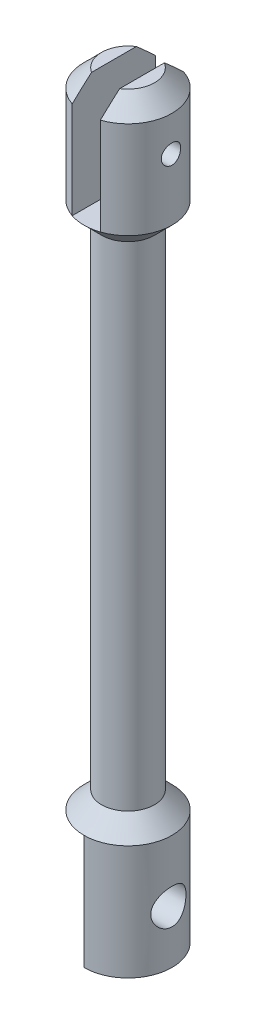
ISO-10303-21;
HEADER;
FILE_DESCRIPTION(('STEP AP214'),'2;1');
FILE_NAME('part.step','',(''),(''),'','','');
FILE_SCHEMA(('AUTOMOTIVE_DESIGN { 1 0 10303 214 1 1 1 1 }'));
ENDSEC;
DATA;
#1=APPLICATION_CONTEXT('core data for automotive mechanical design processes');
#2=APPLICATION_PROTOCOL_DEFINITION('international standard','automotive_design',2000,#1);
#3=PRODUCT_CONTEXT('',#1,'mechanical');
#4=PRODUCT('Part','Part','',(#3));
#5=PRODUCT_RELATED_PRODUCT_CATEGORY('part','',(#4));
#6=PRODUCT_DEFINITION_FORMATION('','',#4);
#7=PRODUCT_DEFINITION_CONTEXT('part definition',#1,'design');
#8=PRODUCT_DEFINITION('design','',#6,#7);
#9=PRODUCT_DEFINITION_SHAPE('','',#8);
#10=(LENGTH_UNIT() NAMED_UNIT(*) SI_UNIT(.MILLI.,.METRE.));
#11=(NAMED_UNIT(*) PLANE_ANGLE_UNIT() SI_UNIT($,.RADIAN.));
#12=(NAMED_UNIT(*) SI_UNIT($,.STERADIAN.) SOLID_ANGLE_UNIT());
#13=UNCERTAINTY_MEASURE_WITH_UNIT(LENGTH_MEASURE(1.E-05),#10,'distance_accuracy_value','');
#14=(GEOMETRIC_REPRESENTATION_CONTEXT(3) GLOBAL_UNCERTAINTY_ASSIGNED_CONTEXT((#13)) GLOBAL_UNIT_ASSIGNED_CONTEXT((#10,
#11,#12)) REPRESENTATION_CONTEXT('',''));
#15=CARTESIAN_POINT('',(0.,0.,0.));
#16=DIRECTION('',(0.,0.,1.));
#17=DIRECTION('',(1.,0.,0.));
#18=AXIS2_PLACEMENT_3D('',#15,#16,#17);
#19=CARTESIAN_POINT('',(-1.5042,43.,-1.284084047));
#20=DIRECTION('',(0.,1.,0.));
#21=DIRECTION('',(0.,0.,1.));
#22=AXIS2_PLACEMENT_3D('',#19,#20,#21);
#23=PLANE('',#22);
#24=CARTESIAN_POINT('',(0.,43.,0.));
#25=DIRECTION('',(0.,-1.,0.));
#26=DIRECTION('',(1.,0.,0.));
#27=AXIS2_PLACEMENT_3D('',#24,#25,#26);
#28=CIRCLE('',#27,1.49999999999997);
#29=CARTESIAN_POINT('',(-0.8,42.9999999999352,-1.26885775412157));
#30=VERTEX_POINT('',#29);
#31=CARTESIAN_POINT('',(-0.8,43.,1.26885775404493));
#32=VERTEX_POINT('',#31);
#33=EDGE_CURVE('E19',#30,#32,#28,.F.);
#34=ORIENTED_EDGE('',*,*,#33,.T.);
#35=DIRECTION('',(0.,0.,1.));
#36=VECTOR('',#35,1.);
#37=CARTESIAN_POINT('',(-0.8,43.,0.));
#38=LINE('',#37,#36);
#39=EDGE_CURVE('E80',#30,#32,#38,.T.);
#40=ORIENTED_EDGE('',*,*,#39,.F.);
#41=EDGE_LOOP('',(#34,#40));
#42=FACE_BOUND('',#41,.T.);
#43=ADVANCED_FACE('F15',(#42),#23,.T.);
#44=CARTESIAN_POINT('',(-0.8,40.,0.));
#45=DIRECTION('',(-1.,0.,0.));
#46=DIRECTION('',(0.,0.,1.));
#47=AXIS2_PLACEMENT_3D('',#44,#45,#46);
#48=CYLINDRICAL_SURFACE('',#47,0.55);
#49=CARTESIAN_POINT('',(-2.43874967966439,39.9999999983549,-0.550000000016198));
#50=CARTESIAN_POINT('',(-2.43875069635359,39.9695318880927,-0.549997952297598));
#51=CARTESIAN_POINT('',(-2.43932707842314,39.9390462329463,-0.547458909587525));
#52=CARTESIAN_POINT('',(-2.44156845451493,39.8789065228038,-0.537372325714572));
#53=CARTESIAN_POINT('',(-2.44323557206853,39.8492542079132,-0.529815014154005));
#54=CARTESIAN_POINT('',(-2.44746027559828,39.7917111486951,-0.50994174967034));
#55=CARTESIAN_POINT('',(-2.45001645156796,39.7638176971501,-0.497633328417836));
#56=CARTESIAN_POINT('',(-2.45572946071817,39.7104989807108,-0.468625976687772));
#57=CARTESIAN_POINT('',(-2.45888611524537,39.6850729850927,-0.451928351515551));
#58=CARTESIAN_POINT('',(-2.46550557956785,39.6369640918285,-0.41430862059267));
#59=CARTESIAN_POINT('',(-2.46897236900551,39.6143296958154,-0.39332517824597));
#60=CARTESIAN_POINT('',(-2.47578680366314,39.5728706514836,-0.347860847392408));
#61=CARTESIAN_POINT('',(-2.47913443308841,39.5540465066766,-0.323379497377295));
#62=CARTESIAN_POINT('',(-2.48537612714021,39.5205534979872,-0.271292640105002));
#63=CARTESIAN_POINT('',(-2.48826499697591,39.5059308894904,-0.243656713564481));
#64=CARTESIAN_POINT('',(-2.49321909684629,39.4815555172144,-0.186245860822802));
#65=CARTESIAN_POINT('',(-2.49528442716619,39.4718021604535,-0.1564711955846));
#66=CARTESIAN_POINT('',(-2.49833086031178,39.4575935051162,-0.096128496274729));
#67=CARTESIAN_POINT('',(-2.49932862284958,39.4530567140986,-0.0655805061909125));
#68=CARTESIAN_POINT('',(-2.5001852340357,39.4491551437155,-0.00414176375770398));
#69=CARTESIAN_POINT('',(-2.50004421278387,39.4497897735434,0.0267489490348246));
#70=CARTESIAN_POINT('',(-2.4986518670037,39.4561524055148,0.0874340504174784));
#71=CARTESIAN_POINT('',(-2.49741970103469,39.461792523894,0.117238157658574));
#72=CARTESIAN_POINT('',(-2.49400534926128,39.4778660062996,0.175466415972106));
#73=CARTESIAN_POINT('',(-2.49182311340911,39.4882996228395,0.203890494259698));
#74=CARTESIAN_POINT('',(-2.48672299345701,39.5137417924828,0.258795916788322));
#75=CARTESIAN_POINT('',(-2.48379977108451,39.5287837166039,0.285261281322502));
#76=CARTESIAN_POINT('',(-2.47753835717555,39.5629894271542,0.335322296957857));
#77=CARTESIAN_POINT('',(-2.47420013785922,39.5821534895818,0.358917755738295));
#78=CARTESIAN_POINT('',(-2.46739314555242,39.6245342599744,0.403090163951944));
#79=CARTESIAN_POINT('',(-2.46392310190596,39.6478272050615,0.423593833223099));
#80=CARTESIAN_POINT('',(-2.45730727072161,39.6975672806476,0.460426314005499));
#81=CARTESIAN_POINT('',(-2.4541616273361,39.724015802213,0.476753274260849));
#82=CARTESIAN_POINT('',(-2.44854672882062,39.779446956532,0.504802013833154));
#83=CARTESIAN_POINT('',(-2.44608008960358,39.8084388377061,0.516506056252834));
#84=CARTESIAN_POINT('',(-2.44213976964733,39.867997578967,0.53482957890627));
#85=CARTESIAN_POINT('',(-2.44066399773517,39.8985609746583,0.541459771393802));
#86=CARTESIAN_POINT('',(-2.43909284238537,39.952842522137,0.54848310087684));
#87=CARTESIAN_POINT('',(-2.4387488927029,39.9764160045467,0.55000158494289));
#88=CARTESIAN_POINT('',(-2.43875069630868,40.0304681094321,0.549997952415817));
#89=CARTESIAN_POINT('',(-2.43932707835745,40.0609537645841,0.547458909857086));
#90=CARTESIAN_POINT('',(-2.44156845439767,40.1210934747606,0.537372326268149));
#91=CARTESIAN_POINT('',(-2.44323557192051,40.1507457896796,0.529815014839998));
#92=CARTESIAN_POINT('',(-2.44746027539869,40.2082888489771,0.509941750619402));
#93=CARTESIAN_POINT('',(-2.45001645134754,40.2361823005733,0.497633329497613));
#94=CARTESIAN_POINT('',(-2.45572946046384,40.2895010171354,0.468625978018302));
#95=CARTESIAN_POINT('',(-2.45888611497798,40.3149270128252,0.451928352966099));
#96=CARTESIAN_POINT('',(-2.46550557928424,40.3630359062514,0.41430862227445));
#97=CARTESIAN_POINT('',(-2.46897236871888,40.3856703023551,0.393325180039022));
#98=CARTESIAN_POINT('',(-2.47578680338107,40.4271293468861,0.347860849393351));
#99=CARTESIAN_POINT('',(-2.47913443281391,40.4459534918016,0.323379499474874));
#100=CARTESIAN_POINT('',(-2.48537612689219,40.4794465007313,0.271292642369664));
#101=CARTESIAN_POINT('',(-2.48826499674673,40.4940691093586,0.243656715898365));
#102=CARTESIAN_POINT('',(-2.49321909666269,40.5184444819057,0.186245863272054));
#103=CARTESIAN_POINT('',(-2.49528442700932,40.5281978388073,0.15647119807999));
#104=CARTESIAN_POINT('',(-2.49833086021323,40.5424064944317,0.0961284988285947));
#105=CARTESIAN_POINT('',(-2.49932862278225,40.5469432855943,0.0655805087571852));
#106=CARTESIAN_POINT('',(-2.50018523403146,40.5508448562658,0.00414176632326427));
#107=CARTESIAN_POINT('',(-2.50004421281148,40.5502102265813,-0.0267489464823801));
#108=CARTESIAN_POINT('',(-2.4986518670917,40.5438475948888,-0.0874340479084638));
#109=CARTESIAN_POINT('',(-2.49741970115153,40.5382074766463,-0.117238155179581));
#110=CARTESIAN_POINT('',(-2.49400534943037,40.5221339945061,-0.175466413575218));
#111=CARTESIAN_POINT('',(-2.49182311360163,40.511700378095,-0.203890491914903));
#112=CARTESIAN_POINT('',(-2.48672299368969,40.4862582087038,-0.258795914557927));
#113=CARTESIAN_POINT('',(-2.48379977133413,40.4712162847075,-0.285261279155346));
#114=CARTESIAN_POINT('',(-2.47753835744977,40.437010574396,-0.335322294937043));
#115=CARTESIAN_POINT('',(-2.4742001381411,40.4178465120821,-0.358917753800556));
#116=CARTESIAN_POINT('',(-2.46739314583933,40.3754657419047,-0.403090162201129));
#117=CARTESIAN_POINT('',(-2.46392310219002,40.3521727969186,-0.423593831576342));
#118=CARTESIAN_POINT('',(-2.45730727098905,40.3024327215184,-0.460426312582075));
#119=CARTESIAN_POINT('',(-2.45416162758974,40.275984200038,-0.476753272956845));
#120=CARTESIAN_POINT('',(-2.44854672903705,40.2205530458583,-0.504802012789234));
#121=CARTESIAN_POINT('',(-2.44608008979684,40.1915611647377,-0.516506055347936));
#122=CARTESIAN_POINT('',(-2.44213976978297,40.132002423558,-0.534829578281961));
#123=CARTESIAN_POINT('',(-2.44066399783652,40.1014390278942,-0.541459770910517));
#124=CARTESIAN_POINT('',(-2.43909284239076,40.0471574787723,-0.548483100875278));
#125=CARTESIAN_POINT('',(-2.43874889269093,40.0235839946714,-0.550001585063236));
#126=CARTESIAN_POINT('',(-2.43874967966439,39.9999999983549,-0.550000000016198));
#127=B_SPLINE_CURVE_WITH_KNOTS('',3,(#49,#50,#51,#52,#53,#54,#55,#56,#57,#58,#59,#60,#61,#62,
#63,#64,#65,#66,#67,#68,#69,#70,#71,#72,#73,#74,#75,#76,#77,#78,#79,#80,#81,#82,#83,#84,#85,#86,
#87,#88,#89,#90,#91,#92,#93,#94,#95,#96,#97,#98,#99,#100,#101,#102,#103,#104,#105,#106,#107,
#108,#109,#110,#111,#112,#113,#114,#115,#116,#117,#118,#119,#120,#121,#122,#123,#124,#125,#126),
.UNSPECIFIED.,.T.,.F.,(4,2,2,2,2,2,2,2,2,2,2,2,2,2,2,2,2,2,2,2,2,2,2,2,2,2,2,2,2,2,2,2,2,2,2,2,
2,2,4),(0.,0.0913251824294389,0.182828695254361,0.274187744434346,0.365519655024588,
0.45826397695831,0.551020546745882,0.644762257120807,0.73849254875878,0.83073780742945,
0.922972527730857,1.01361918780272,1.1042706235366,1.19559468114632,1.28692485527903,
1.38016124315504,1.47343888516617,1.56707101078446,1.66050490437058,1.73119562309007,
1.82252080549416,1.91402431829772,2.00538336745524,2.0967152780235,2.18945959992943,
2.28221616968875,2.37595788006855,2.46968817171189,2.56193343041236,2.65416815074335,
2.74481481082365,2.83546624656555,2.92679030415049,3.01812047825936,3.11135686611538,
3.20463450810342,3.29826663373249,3.39170052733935,3.4623912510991),.UNSPECIFIED.);
#128=CARTESIAN_POINT('',(-2.43874967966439,39.9999999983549,-0.550000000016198));
#129=VERTEX_POINT('',#128);
#130=EDGE_CURVE('E169',#129,#129,#127,.T.);
#131=ORIENTED_EDGE('',*,*,#130,.T.);
#132=EDGE_LOOP('',(#131));
#133=FACE_BOUND('',#132,.T.);
#134=CARTESIAN_POINT('',(-0.8,40.,0.));
#135=DIRECTION('',(-1.,0.,0.));
#136=DIRECTION('',(0.,0.,1.));
#137=AXIS2_PLACEMENT_3D('',#134,#135,#136);
#138=CIRCLE('',#137,0.55);
#139=CARTESIAN_POINT('',(-0.8,40.,0.55));
#140=VERTEX_POINT('',#139);
#141=EDGE_CURVE('E93',#140,#140,#138,.T.);
#142=ORIENTED_EDGE('',*,*,#141,.F.);
#143=EDGE_LOOP('',(#142));
#144=FACE_BOUND('',#143,.T.);
#145=ADVANCED_FACE('F178',(#133,#144),#48,.F.);
#146=CARTESIAN_POINT('',(0.,43.,0.));
#147=DIRECTION('',(0.,-1.,0.));
#148=DIRECTION('',(1.,0.,0.));
#149=AXIS2_PLACEMENT_3D('',#146,#147,#148);
#150=CONICAL_SURFACE('',#149,1.5,0.785398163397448);
#151=CARTESIAN_POINT('',(-0.799999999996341,42.9999999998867,1.26885775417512));
#152=CARTESIAN_POINT('',(-0.799999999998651,42.9599805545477,1.31615088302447));
#153=CARTESIAN_POINT('',(-0.79999999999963,42.9196090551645,1.36314265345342));
#154=CARTESIAN_POINT('',(-0.80000000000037,42.8383030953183,1.45663280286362));
#155=CARTESIAN_POINT('',(-0.800000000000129,42.7973686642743,1.50313120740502));
#156=CARTESIAN_POINT('',(-0.799999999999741,42.6739404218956,1.64204184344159));
#157=CARTESIAN_POINT('',(-0.799999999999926,42.5908078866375,1.73388558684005));
#158=CARTESIAN_POINT('',(-0.800000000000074,42.4234828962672,1.91657711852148));
#159=CARTESIAN_POINT('',(-0.800000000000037,42.3392905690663,2.00742502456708));
#160=CARTESIAN_POINT('',(-0.799999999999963,42.1701383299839,2.18843350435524));
#161=CARTESIAN_POINT('',(-0.799999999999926,42.0851782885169,2.27859395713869));
#162=CARTESIAN_POINT('',(-0.8,41.9999999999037,2.36854385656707));
#163=B_SPLINE_CURVE_WITH_KNOTS('',3,(#151,#152,#153,#154,#155,#156,#157,#158,#159,#160,#161,
#162),.UNSPECIFIED.,.F.,.F.,(4,2,2,2,2,4),(0.,0.185853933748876,0.371698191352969,
0.743323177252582,1.11490373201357,1.4865482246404),.UNSPECIFIED.);
#164=CARTESIAN_POINT('',(-0.800000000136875,41.9999999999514,2.36854385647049));
#165=VERTEX_POINT('',#164);
#166=EDGE_CURVE('E83',#32,#165,#163,.T.);
#167=ORIENTED_EDGE('',*,*,#166,.F.);
#168=ORIENTED_EDGE('',*,*,#33,.F.);
#169=CARTESIAN_POINT('',(-0.8,41.9999999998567,-2.36854385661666));
#170=CARTESIAN_POINT('',(-0.8,42.0851782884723,-2.27859395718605));
#171=CARTESIAN_POINT('',(-0.8,42.1701383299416,-2.18843350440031));
#172=CARTESIAN_POINT('',(-0.8,42.3392905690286,-2.00742502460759));
#173=CARTESIAN_POINT('',(-0.8,42.4234828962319,-1.91657711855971));
#174=CARTESIAN_POINT('',(-0.8,42.5908078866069,-1.73388558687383));
#175=CARTESIAN_POINT('',(-0.8,42.6739404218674,-1.64204184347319));
#176=CARTESIAN_POINT('',(-0.8,42.7973686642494,-1.50313120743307));
#177=CARTESIAN_POINT('',(-0.8,42.8383030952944,-1.45663280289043));
#178=CARTESIAN_POINT('',(-0.8,42.9196090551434,-1.36314265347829));
#179=CARTESIAN_POINT('',(-0.8,42.9599805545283,-1.31615088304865));
#180=CARTESIAN_POINT('',(-0.8,42.9999999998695,-1.26885775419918));
#181=B_SPLINE_CURVE_WITH_KNOTS('',3,(#169,#170,#171,#172,#173,#174,#175,#176,#177,#178,#179,
#180),.UNSPECIFIED.,.F.,.F.,(4,2,2,2,2,4),(0.,0.371644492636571,0.743225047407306,
1.11485003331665,1.30069429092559,1.48654822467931),.UNSPECIFIED.);
#182=CARTESIAN_POINT('',(-0.799999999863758,41.9999999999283,-2.36854385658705));
#183=VERTEX_POINT('',#182);
#184=EDGE_CURVE('E86',#183,#30,#181,.T.);
#185=ORIENTED_EDGE('',*,*,#184,.F.);
#186=CARTESIAN_POINT('',(0.,42.,0.));
#187=DIRECTION('',(0.,-1.,0.));
#188=DIRECTION('',(0.,0.,-1.));
#189=AXIS2_PLACEMENT_3D('',#186,#187,#188);
#190=CIRCLE('',#189,2.5);
#191=EDGE_CURVE('E92',#183,#165,#190,.F.);
#192=ORIENTED_EDGE('',*,*,#191,.T.);
#193=EDGE_LOOP('',(#167,#168,#185,#192));
#194=FACE_BOUND('',#193,.T.);
#195=ADVANCED_FACE('F90',(#194),#150,.T.);
#196=CARTESIAN_POINT('',(-0.8,36.5,2.368543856));
#197=DIRECTION('',(1.,0.,0.));
#198=DIRECTION('',(0.,0.,-1.));
#199=AXIS2_PLACEMENT_3D('',#196,#197,#198);
#200=PLANE('',#199);
#201=ORIENTED_EDGE('',*,*,#141,.T.);
#202=EDGE_LOOP('',(#201));
#203=FACE_BOUND('',#202,.T.);
#204=ORIENTED_EDGE('',*,*,#39,.T.);
#205=ORIENTED_EDGE('',*,*,#166,.T.);
#206=DIRECTION('',(0.,1.,0.));
#207=VECTOR('',#206,1.);
#208=CARTESIAN_POINT('',(-0.800000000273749,39.25,2.36854385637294));
#209=LINE('',#208,#207);
#210=CARTESIAN_POINT('',(-0.800000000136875,36.5,2.36854385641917));
#211=VERTEX_POINT('',#210);
#212=EDGE_CURVE('E243',#165,#211,#209,.F.);
#213=ORIENTED_EDGE('',*,*,#212,.T.);
#214=DIRECTION('',(0.,0.,1.));
#215=VECTOR('',#214,1.);
#216=CARTESIAN_POINT('',(-0.8,36.5,0.));
#217=LINE('',#216,#215);
#218=CARTESIAN_POINT('',(-0.799999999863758,36.5,-2.36854385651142));
#219=VERTEX_POINT('',#218);
#220=EDGE_CURVE('E96',#219,#211,#217,.T.);
#221=ORIENTED_EDGE('',*,*,#220,.F.);
#222=DIRECTION('',(0.,-1.,0.));
#223=VECTOR('',#222,1.);
#224=CARTESIAN_POINT('',(-0.799999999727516,39.25,-2.36854385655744));
#225=LINE('',#224,#223);
#226=EDGE_CURVE('E175',#219,#183,#225,.F.);
#227=ORIENTED_EDGE('',*,*,#226,.T.);
#228=ORIENTED_EDGE('',*,*,#184,.T.);
#229=EDGE_LOOP('',(#204,#205,#213,#221,#227,#228));
#230=FACE_BOUND('',#229,.T.);
#231=ADVANCED_FACE('F81',(#203,#230),#200,.T.);
#232=CARTESIAN_POINT('',(-0.8,36.5,-2.53));
#233=DIRECTION('',(0.,1.,0.));
#234=DIRECTION('',(0.,0.,1.));
#235=AXIS2_PLACEMENT_3D('',#232,#233,#234);
#236=PLANE('',#235);
#237=DIRECTION('',(0.,0.,-1.));
#238=VECTOR('',#237,1.);
#239=CARTESIAN_POINT('',(0.8,36.5,0.));
#240=LINE('',#239,#238);
#241=CARTESIAN_POINT('',(0.800000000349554,36.5,2.36854385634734));
#242=VERTEX_POINT('',#241);
#243=CARTESIAN_POINT('',(0.799999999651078,36.5,-2.36854385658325));
#244=VERTEX_POINT('',#243);
#245=EDGE_CURVE('E235',#242,#244,#240,.T.);
#246=ORIENTED_EDGE('',*,*,#245,.T.);
#247=CARTESIAN_POINT('',(0.,36.5,0.));
#248=DIRECTION('',(0.,1.,0.));
#249=DIRECTION('',(0.,0.,1.));
#250=AXIS2_PLACEMENT_3D('',#247,#248,#249);
#251=CIRCLE('',#250,2.5);
#252=EDGE_CURVE('E176',#244,#219,#251,.T.);
#253=ORIENTED_EDGE('',*,*,#252,.T.);
#254=ORIENTED_EDGE('',*,*,#220,.T.);
#255=CARTESIAN_POINT('',(0.,36.5,0.));
#256=DIRECTION('',(0.,1.,0.));
#257=DIRECTION('',(0.,0.,1.));
#258=AXIS2_PLACEMENT_3D('',#255,#256,#257);
#259=CIRCLE('',#258,2.5);
#260=EDGE_CURVE('E248',#211,#242,#259,.T.);
#261=ORIENTED_EDGE('',*,*,#260,.T.);
#262=EDGE_LOOP('',(#246,#253,#254,#261));
#263=FACE_BOUND('',#262,.T.);
#264=ADVANCED_FACE('F114',(#263),#236,.T.);
#265=CARTESIAN_POINT('',(0.8,43.,-1.284084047));
#266=DIRECTION('',(0.,1.,0.));
#267=DIRECTION('',(0.,0.,1.));
#268=AXIS2_PLACEMENT_3D('',#265,#266,#267);
#269=PLANE('',#268);
#270=DIRECTION('',(0.,0.,1.));
#271=VECTOR('',#270,1.);
#272=CARTESIAN_POINT('',(0.8,43.,0.));
#273=LINE('',#272,#271);
#274=CARTESIAN_POINT('',(0.8,43.0000000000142,-1.26885775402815));
#275=VERTEX_POINT('',#274);
#276=CARTESIAN_POINT('',(0.8,43.,1.26885775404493));
#277=VERTEX_POINT('',#276);
#278=EDGE_CURVE('E232',#275,#277,#273,.T.);
#279=ORIENTED_EDGE('',*,*,#278,.T.);
#280=CARTESIAN_POINT('',(0.,43.,0.));
#281=DIRECTION('',(0.,-1.,0.));
#282=DIRECTION('',(1.,0.,0.));
#283=AXIS2_PLACEMENT_3D('',#280,#281,#282);
#284=CIRCLE('',#283,1.49999999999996);
#285=EDGE_CURVE('E274',#277,#275,#284,.F.);
#286=ORIENTED_EDGE('',*,*,#285,.T.);
#287=EDGE_LOOP('',(#279,#286));
#288=FACE_BOUND('',#287,.T.);
#289=ADVANCED_FACE('F119',(#288),#269,.T.);
#290=CARTESIAN_POINT('',(0.,42.,0.));
#291=DIRECTION('',(0.,-1.,0.));
#292=DIRECTION('',(0.,0.,-1.));
#293=AXIS2_PLACEMENT_3D('',#290,#291,#292);
#294=CYLINDRICAL_SURFACE('',#293,2.5);
#295=ORIENTED_EDGE('',*,*,#191,.F.);
#296=ORIENTED_EDGE('',*,*,#226,.F.);
#297=CARTESIAN_POINT('',(0.,36.5,0.));
#298=DIRECTION('',(0.,1.,0.));
#299=DIRECTION('',(0.,0.,1.));
#300=AXIS2_PLACEMENT_3D('',#297,#298,#299);
#301=CIRCLE('',#300,2.5);
#302=EDGE_CURVE('E148',#219,#211,#301,.T.);
#303=ORIENTED_EDGE('',*,*,#302,.T.);
#304=ORIENTED_EDGE('',*,*,#212,.F.);
#305=EDGE_LOOP('',(#295,#296,#303,#304));
#306=FACE_BOUND('',#305,.T.);
#307=ORIENTED_EDGE('',*,*,#130,.F.);
#308=EDGE_LOOP('',(#307));
#309=FACE_BOUND('',#308,.T.);
#310=ADVANCED_FACE('F123',(#306,#309),#294,.T.);
#311=CARTESIAN_POINT('',(2.51020234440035,40.,0.));
#312=DIRECTION('',(-1.,0.,0.));
#313=DIRECTION('',(0.,0.,1.));
#314=AXIS2_PLACEMENT_3D('',#311,#312,#313);
#315=CYLINDRICAL_SURFACE('',#314,0.55);
#316=CARTESIAN_POINT('',(2.43874967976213,39.9999999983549,-0.550000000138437));
#317=CARTESIAN_POINT('',(2.43875069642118,40.0304681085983,-0.549997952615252));
#318=CARTESIAN_POINT('',(2.43932707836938,40.0609537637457,-0.547458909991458));
#319=CARTESIAN_POINT('',(2.44156845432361,40.1210934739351,-0.537372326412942));
#320=CARTESIAN_POINT('',(2.44323557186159,40.1507457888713,-0.52981501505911));
#321=CARTESIAN_POINT('',(2.44746027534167,40.2082888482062,-0.509941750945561));
#322=CARTESIAN_POINT('',(2.45001645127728,40.2361822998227,-0.497633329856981));
#323=CARTESIAN_POINT('',(2.45572946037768,40.2895010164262,-0.468625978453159));
#324=CARTESIAN_POINT('',(2.45888611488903,40.3149270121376,-0.451928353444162));
#325=CARTESIAN_POINT('',(2.4655055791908,40.3630359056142,-0.414308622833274));
#326=CARTESIAN_POINT('',(2.46897236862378,40.3856703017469,-0.393325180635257));
#327=CARTESIAN_POINT('',(2.47578680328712,40.4271293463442,-0.347860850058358));
#328=CARTESIAN_POINT('',(2.47913443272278,40.4459534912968,-0.323379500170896));
#329=CARTESIAN_POINT('',(2.48537612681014,40.4794465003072,-0.271292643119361));
#330=CARTESIAN_POINT('',(2.48826499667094,40.4940691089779,-0.243656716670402));
#331=CARTESIAN_POINT('',(2.49321909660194,40.5184444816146,-0.186245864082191));
#332=CARTESIAN_POINT('',(2.49528442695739,40.5281978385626,-0.156471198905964));
#333=CARTESIAN_POINT('',(2.49833086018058,40.5424064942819,-0.0961284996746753));
#334=CARTESIAN_POINT('',(2.49932862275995,40.5469432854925,-0.0655805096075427));
#335=CARTESIAN_POINT('',(2.50018523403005,40.5508448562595,-0.00414176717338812));
#336=CARTESIAN_POINT('',(2.50004421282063,40.5502102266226,0.0267489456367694));
#337=CARTESIAN_POINT('',(2.49865186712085,40.5438475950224,0.0874340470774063));
#338=CARTESIAN_POINT('',(2.49741970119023,40.5382074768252,0.117238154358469));
#339=CARTESIAN_POINT('',(2.49400534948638,40.522133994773,0.175466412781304));
#340=CARTESIAN_POINT('',(2.4918231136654,40.5117003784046,0.203890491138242));
#341=CARTESIAN_POINT('',(2.48672299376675,40.4862582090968,0.258795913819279));
#342=CARTESIAN_POINT('',(2.48379977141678,40.4712162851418,0.285261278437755));
#343=CARTESIAN_POINT('',(2.47753835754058,40.4370105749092,0.335322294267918));
#344=CARTESIAN_POINT('',(2.47420013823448,40.4178465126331,0.358917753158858));
#345=CARTESIAN_POINT('',(2.46739314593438,40.3754657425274,0.403090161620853));
#346=CARTESIAN_POINT('',(2.46392310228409,40.3521727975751,0.423593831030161));
#347=CARTESIAN_POINT('',(2.45730727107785,40.3024327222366,0.460426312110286));
#348=CARTESIAN_POINT('',(2.45416162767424,40.275984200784,0.476753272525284));
#349=CARTESIAN_POINT('',(2.4485467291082,40.2205530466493,0.504802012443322));
#350=CARTESIAN_POINT('',(2.446080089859,40.1915611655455,0.516506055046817));
#351=CARTESIAN_POINT('',(2.4421397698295,40.1320024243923,0.534829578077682));
#352=CARTESIAN_POINT('',(2.44066399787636,40.1014390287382,0.541459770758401));
#353=CARTESIAN_POINT('',(2.43909284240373,40.0471574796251,0.548483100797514));
#354=CARTESIAN_POINT('',(2.43874889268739,40.0235839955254,0.550001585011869));
#355=CARTESIAN_POINT('',(2.43875069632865,39.9695318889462,0.549997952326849));
#356=CARTESIAN_POINT('',(2.43932707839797,39.9390462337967,0.547458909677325));
#357=CARTESIAN_POINT('',(2.44156845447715,39.8789065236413,0.53737232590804));
#358=CARTESIAN_POINT('',(2.44323557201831,39.849254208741,0.529815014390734));
#359=CARTESIAN_POINT('',(2.4474602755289,39.7917111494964,0.509941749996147));
#360=CARTESIAN_POINT('',(2.45001645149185,39.7638176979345,0.497633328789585));
#361=CARTESIAN_POINT('',(2.45572946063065,39.7104989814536,0.468625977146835));
#362=CARTESIAN_POINT('',(2.4588861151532,39.6850729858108,0.451928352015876));
#363=CARTESIAN_POINT('',(2.46550557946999,39.6369640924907,0.414308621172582));
#364=CARTESIAN_POINT('',(2.46897236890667,39.6143296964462,0.393325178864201));
#365=CARTESIAN_POINT('',(2.47578680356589,39.5728706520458,0.347860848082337));
#366=CARTESIAN_POINT('',(2.47913443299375,39.5540465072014,0.323379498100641));
#367=CARTESIAN_POINT('',(2.48537612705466,39.5205534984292,0.271292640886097));
#368=CARTESIAN_POINT('',(2.48826499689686,39.5059308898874,0.243656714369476));
#369=CARTESIAN_POINT('',(2.49321909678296,39.4815555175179,0.186245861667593));
#370=CARTESIAN_POINT('',(2.49528442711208,39.4718021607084,0.15647119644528));
#371=CARTESIAN_POINT('',(2.49833086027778,39.4575935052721,0.0961284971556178));
#372=CARTESIAN_POINT('',(2.49932862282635,39.4530567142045,0.0655805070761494));
#373=CARTESIAN_POINT('',(2.50018523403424,39.449155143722,0.00414176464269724));
#374=CARTESIAN_POINT('',(2.50004421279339,39.4497897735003,-0.0267489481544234));
#375=CARTESIAN_POINT('',(2.49865186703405,39.4561524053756,-0.0874340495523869));
#376=CARTESIAN_POINT('',(2.49741970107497,39.4617925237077,-0.117238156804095));
#377=CARTESIAN_POINT('',(2.49400534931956,39.4778660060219,-0.175466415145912));
#378=CARTESIAN_POINT('',(2.49182311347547,39.4882996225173,-0.203890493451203));
#379=CARTESIAN_POINT('',(2.48672299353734,39.5137417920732,-0.258795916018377));
#380=CARTESIAN_POINT('',(2.4837997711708,39.5287837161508,-0.285261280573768));
#381=CARTESIAN_POINT('',(2.47753835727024,39.5629894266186,-0.335322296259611));
#382=CARTESIAN_POINT('',(2.47420013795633,39.5821534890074,-0.358917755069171));
#383=CARTESIAN_POINT('',(2.46739314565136,39.6245342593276,-0.403090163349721));
#384=CARTESIAN_POINT('',(2.46392310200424,39.6478272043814,-0.423593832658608));
#385=CARTESIAN_POINT('',(2.45730727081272,39.6975672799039,-0.460426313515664));
#386=CARTESIAN_POINT('',(2.45416162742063,39.7240158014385,-0.476753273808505));
#387=CARTESIAN_POINT('',(2.44854672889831,39.7794469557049,-0.504802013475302));
#388=CARTESIAN_POINT('',(2.4460800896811,39.8084388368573,-0.516506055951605));
#389=CARTESIAN_POINT('',(2.44213976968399,39.8679975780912,-0.534829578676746));
#390=CARTESIAN_POINT('',(2.44066399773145,39.8985609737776,-0.541459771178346));
#391=CARTESIAN_POINT('',(2.4390928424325,39.9528425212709,-0.548483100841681));
#392=CARTESIAN_POINT('',(2.43874889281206,39.9764160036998,-0.550001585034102));
#393=CARTESIAN_POINT('',(2.43874967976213,39.9999999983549,-0.550000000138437));
#394=B_SPLINE_CURVE_WITH_KNOTS('',3,(#316,#317,#318,#319,#320,#321,#322,#323,#324,#325,#326,
#327,#328,#329,#330,#331,#332,#333,#334,#335,#336,#337,#338,#339,#340,#341,#342,#343,#344,#345,
#346,#347,#348,#349,#350,#351,#352,#353,#354,#355,#356,#357,#358,#359,#360,#361,#362,#363,#364,
#365,#366,#367,#368,#369,#370,#371,#372,#373,#374,#375,#376,#377,#378,#379,#380,#381,#382,#383,
#384,#385,#386,#387,#388,#389,#390,#391,#392,#393),.UNSPECIFIED.,.T.,.F.,(4,2,2,2,2,2,2,2,2,2,2,
2,2,2,2,2,2,2,2,2,2,2,2,2,2,2,2,2,2,2,2,2,2,2,2,2,2,2,4),(0.,0.0913251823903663,
0.182828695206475,0.274187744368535,0.365519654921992,0.458263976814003,0.551020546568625,
0.644762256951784,0.738492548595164,0.830737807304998,0.922972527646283,1.01361918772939,
1.10427062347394,1.19559468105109,1.28692485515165,1.38016124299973,1.47343888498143,
1.56707101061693,1.6605049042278,1.73119562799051,1.8225208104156,1.91402432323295,
2.00538337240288,2.09671528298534,2.1894596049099,2.28221617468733,2.37595788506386,
2.46968817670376,2.56193343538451,2.65416815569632,2.74481481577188,2.83546625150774,
2.92679030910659,3.0181204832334,3.11135687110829,3.20463451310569,3.29826663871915,
3.39170053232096,3.46239125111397),.UNSPECIFIED.);
#395=CARTESIAN_POINT('',(2.43874967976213,39.9999999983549,-0.550000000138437));
#396=VERTEX_POINT('',#395);
#397=EDGE_CURVE('E149',#396,#396,#394,.T.);
#398=ORIENTED_EDGE('',*,*,#397,.T.);
#399=EDGE_LOOP('',(#398));
#400=FACE_BOUND('',#399,.T.);
#401=CARTESIAN_POINT('',(0.8,40.,0.));
#402=DIRECTION('',(-1.,0.,0.));
#403=DIRECTION('',(0.,0.,1.));
#404=AXIS2_PLACEMENT_3D('',#401,#402,#403);
#405=CIRCLE('',#404,0.55);
#406=CARTESIAN_POINT('',(0.8,40.,0.55));
#407=VERTEX_POINT('',#406);
#408=EDGE_CURVE('E177',#407,#407,#405,.T.);
#409=ORIENTED_EDGE('',*,*,#408,.T.);
#410=EDGE_LOOP('',(#409));
#411=FACE_BOUND('',#410,.T.);
#412=ADVANCED_FACE('F130',(#400,#411),#315,.F.);
#413=CARTESIAN_POINT('',(0.8,36.5,2.368543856));
#414=DIRECTION('',(1.,0.,0.));
#415=DIRECTION('',(0.,0.,-1.));
#416=AXIS2_PLACEMENT_3D('',#413,#414,#415);
#417=PLANE('',#416);
#418=ORIENTED_EDGE('',*,*,#408,.F.);
#419=EDGE_LOOP('',(#418));
#420=FACE_BOUND('',#419,.T.);
#421=ORIENTED_EDGE('',*,*,#278,.F.);
#422=CARTESIAN_POINT('',(0.8,43.0000000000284,-1.26885775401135));
#423=CARTESIAN_POINT('',(0.8,42.9599805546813,-1.31615088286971));
#424=CARTESIAN_POINT('',(0.8,42.9196090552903,-1.36314265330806));
#425=CARTESIAN_POINT('',(0.8,42.8383030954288,-1.45663280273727));
#426=CARTESIAN_POINT('',(0.8,42.7973686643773,-1.50313120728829));
#427=CARTESIAN_POINT('',(0.8,42.6739404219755,-1.64204184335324));
#428=CARTESIAN_POINT('',(0.8,42.5908078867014,-1.73388558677));
#429=CARTESIAN_POINT('',(0.8,42.4234828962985,-1.91657711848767));
#430=CARTESIAN_POINT('',(0.8,42.3392905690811,-2.00742502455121));
#431=CARTESIAN_POINT('',(0.8,42.1701383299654,-2.18843350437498));
#432=CARTESIAN_POINT('',(0.8,42.0851782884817,-2.27859395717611));
#433=CARTESIAN_POINT('',(0.8,41.9999999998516,-2.36854385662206));
#434=B_SPLINE_CURVE_WITH_KNOTS('',3,(#422,#423,#424,#425,#426,#427,#428,#429,#430,#431,#432,
#433),.UNSPECIFIED.,.F.,.F.,(4,2,2,2,2,4),(0.,0.185853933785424,0.371698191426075,
0.743323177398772,1.11490373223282,1.48654822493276),.UNSPECIFIED.);
#435=CARTESIAN_POINT('',(0.799999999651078,41.9999999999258,-2.36854385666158));
#436=VERTEX_POINT('',#435);
#437=EDGE_CURVE('E135',#275,#436,#434,.T.);
#438=ORIENTED_EDGE('',*,*,#437,.T.);
#439=DIRECTION('',(0.,1.,0.));
#440=VECTOR('',#439,1.);
#441=CARTESIAN_POINT('',(0.799999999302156,39.25,-2.36854385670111));
#442=LINE('',#441,#440);
#443=EDGE_CURVE('E241',#436,#244,#442,.F.);
#444=ORIENTED_EDGE('',*,*,#443,.T.);
#445=ORIENTED_EDGE('',*,*,#245,.F.);
#446=DIRECTION('',(0.,-1.,0.));
#447=VECTOR('',#446,1.);
#448=CARTESIAN_POINT('',(0.800000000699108,39.25,2.36854385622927));
#449=LINE('',#448,#447);
#450=CARTESIAN_POINT('',(0.800000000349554,42.0000000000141,2.36854385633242));
#451=VERTEX_POINT('',#450);
#452=EDGE_CURVE('E238',#242,#451,#449,.F.);
#453=ORIENTED_EDGE('',*,*,#452,.T.);
#454=CARTESIAN_POINT('',(0.800000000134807,42.000000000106,2.36854385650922));
#455=CARTESIAN_POINT('',(0.800000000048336,42.0851782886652,2.27859395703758));
#456=CARTESIAN_POINT('',(0.800000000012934,42.1701383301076,2.1884335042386));
#457=CARTESIAN_POINT('',(0.799999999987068,42.3392905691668,2.00742502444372));
#458=CARTESIAN_POINT('',(0.799999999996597,42.4234828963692,1.91657711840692));
#459=CARTESIAN_POINT('',(0.800000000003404,42.5908078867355,1.73388558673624));
#460=CARTESIAN_POINT('',(0.800000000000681,42.6739404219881,1.64204184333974));
#461=CARTESIAN_POINT('',(0.79999999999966,42.7973686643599,1.50313120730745));
#462=CARTESIAN_POINT('',(0.79999999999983,42.8383030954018,1.45663280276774));
#463=CARTESIAN_POINT('',(0.80000000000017,42.9196090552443,1.36314265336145));
#464=CARTESIAN_POINT('',(0.800000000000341,42.959980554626,1.31615088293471));
#465=CARTESIAN_POINT('',(0.8,42.9999999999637,1.26885775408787));
#466=B_SPLINE_CURVE_WITH_KNOTS('',3,(#454,#455,#456,#457,#458,#459,#460,#461,#462,#463,#464,
#465),.UNSPECIFIED.,.F.,.F.,(4,2,2,2,2,4),(0.,0.371644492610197,0.743225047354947,
1.11485003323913,1.30069429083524,1.486548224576),.UNSPECIFIED.);
#467=EDGE_CURVE('E142',#451,#277,#466,.T.);
#468=ORIENTED_EDGE('',*,*,#467,.T.);
#469=EDGE_LOOP('',(#421,#438,#444,#445,#453,#468));
#470=FACE_BOUND('',#469,.T.);
#471=ADVANCED_FACE('F125',(#420,#470),#417,.F.);
#472=CARTESIAN_POINT('',(0.,43.,0.));
#473=DIRECTION('',(0.,-1.,0.));
#474=DIRECTION('',(1.,0.,0.));
#475=AXIS2_PLACEMENT_3D('',#472,#473,#474);
#476=CONICAL_SURFACE('',#475,1.5,0.785398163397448);
#477=CARTESIAN_POINT('',(0.,42.,0.));
#478=DIRECTION('',(0.,-1.,0.));
#479=DIRECTION('',(0.,0.,-1.));
#480=AXIS2_PLACEMENT_3D('',#477,#478,#479);
#481=CIRCLE('',#480,2.5);
#482=EDGE_CURVE('E227',#451,#436,#481,.F.);
#483=ORIENTED_EDGE('',*,*,#482,.T.);
#484=ORIENTED_EDGE('',*,*,#437,.F.);
#485=ORIENTED_EDGE('',*,*,#285,.F.);
#486=ORIENTED_EDGE('',*,*,#467,.F.);
#487=EDGE_LOOP('',(#483,#484,#485,#486));
#488=FACE_BOUND('',#487,.T.);
#489=ADVANCED_FACE('F129',(#488),#476,.T.);
#490=CARTESIAN_POINT('',(0.,42.,0.));
#491=DIRECTION('',(0.,-1.,0.));
#492=DIRECTION('',(0.,0.,-1.));
#493=AXIS2_PLACEMENT_3D('',#490,#491,#492);
#494=CYLINDRICAL_SURFACE('',#493,2.5);
#495=ORIENTED_EDGE('',*,*,#452,.F.);
#496=CARTESIAN_POINT('',(0.,36.5,0.));
#497=DIRECTION('',(0.,1.,0.));
#498=DIRECTION('',(0.,0.,1.));
#499=AXIS2_PLACEMENT_3D('',#496,#497,#498);
#500=CIRCLE('',#499,2.5);
#501=EDGE_CURVE('E222',#242,#244,#500,.T.);
#502=ORIENTED_EDGE('',*,*,#501,.T.);
#503=ORIENTED_EDGE('',*,*,#443,.F.);
#504=ORIENTED_EDGE('',*,*,#482,.F.);
#505=EDGE_LOOP('',(#495,#502,#503,#504));
#506=FACE_BOUND('',#505,.T.);
#507=ORIENTED_EDGE('',*,*,#397,.F.);
#508=EDGE_LOOP('',(#507));
#509=FACE_BOUND('',#508,.T.);
#510=ADVANCED_FACE('F157',(#506,#509),#494,.T.);
#511=CARTESIAN_POINT('',(0.,35.5,0.));
#512=DIRECTION('',(0.,1.,0.));
#513=DIRECTION('',(0.,0.,1.));
#514=AXIS2_PLACEMENT_3D('',#511,#512,#513);
#515=CONICAL_SURFACE('',#514,1.5,0.785398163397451);
#516=CARTESIAN_POINT('',(0.,35.5,0.));
#517=DIRECTION('',(0.,-1.,0.));
#518=DIRECTION('',(0.,0.,-1.));
#519=AXIS2_PLACEMENT_3D('',#516,#517,#518);
#520=CIRCLE('',#519,1.5);
#521=CARTESIAN_POINT('',(0.,35.5,-1.5));
#522=VERTEX_POINT('',#521);
#523=EDGE_CURVE('E215',#522,#522,#520,.F.);
#524=ORIENTED_EDGE('',*,*,#523,.T.);
#525=EDGE_LOOP('',(#524));
#526=FACE_BOUND('',#525,.T.);
#527=ORIENTED_EDGE('',*,*,#260,.F.);
#528=ORIENTED_EDGE('',*,*,#302,.F.);
#529=ORIENTED_EDGE('',*,*,#252,.F.);
#530=ORIENTED_EDGE('',*,*,#501,.F.);
#531=EDGE_LOOP('',(#527,#528,#529,#530));
#532=FACE_BOUND('',#531,.T.);
#533=ADVANCED_FACE('F259',(#526,#532),#515,.T.);
#534=CARTESIAN_POINT('',(0.,35.5,0.));
#535=DIRECTION('',(0.,-1.,0.));
#536=DIRECTION('',(0.,0.,-1.));
#537=AXIS2_PLACEMENT_3D('',#534,#535,#536);
#538=CYLINDRICAL_SURFACE('',#537,1.5);
#539=CARTESIAN_POINT('',(0.,7.50000000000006,0.));
#540=DIRECTION('',(0.,-1.,0.));
#541=DIRECTION('',(0.,0.,-1.));
#542=AXIS2_PLACEMENT_3D('',#539,#540,#541);
#543=CIRCLE('',#542,1.5);
#544=CARTESIAN_POINT('',(0.,7.5,-1.5));
#545=VERTEX_POINT('',#544);
#546=EDGE_CURVE('E214',#545,#545,#543,.F.);
#547=ORIENTED_EDGE('',*,*,#546,.T.);
#548=EDGE_LOOP('',(#547));
#549=FACE_BOUND('',#548,.T.);
#550=ORIENTED_EDGE('',*,*,#523,.F.);
#551=EDGE_LOOP('',(#550));
#552=FACE_BOUND('',#551,.T.);
#553=ADVANCED_FACE('F264',(#549,#552),#538,.T.);
#554=CARTESIAN_POINT('',(-2.515,6.5,2.53));
#555=DIRECTION('',(0.,-1.,0.));
#556=DIRECTION('',(0.,0.,-1.));
#557=AXIS2_PLACEMENT_3D('',#554,#555,#556);
#558=PLANE('',#557);
#559=CARTESIAN_POINT('',(0.,6.49999999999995,0.));
#560=DIRECTION('',(0.,-1.,0.));
#561=DIRECTION('',(1.,0.,0.));
#562=AXIS2_PLACEMENT_3D('',#559,#560,#561);
#563=CIRCLE('',#562,2.50000000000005);
#564=CARTESIAN_POINT('',(-5.12758571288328E-10,6.49999999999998,2.50000000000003));
#565=VERTEX_POINT('',#564);
#566=CARTESIAN_POINT('',(-2.24484139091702E-10,6.49999999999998,-2.50000000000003));
#567=VERTEX_POINT('',#566);
#568=EDGE_CURVE('E33',#565,#567,#563,.T.);
#569=ORIENTED_EDGE('',*,*,#568,.T.);
#570=DIRECTION('',(0.,0.,1.));
#571=VECTOR('',#570,1.);
#572=CARTESIAN_POINT('',(0.,6.5,0.));
#573=LINE('',#572,#571);
#574=EDGE_CURVE('E219',#567,#565,#573,.T.);
#575=ORIENTED_EDGE('',*,*,#574,.T.);
#576=EDGE_LOOP('',(#569,#575));
#577=FACE_BOUND('',#576,.T.);
#578=ADVANCED_FACE('F132',(#577),#558,.T.);
#579=CARTESIAN_POINT('',(0.,0.,-2.53));
#580=DIRECTION('',(0.,1.,0.));
#581=DIRECTION('',(0.,0.,1.));
#582=AXIS2_PLACEMENT_3D('',#579,#580,#581);
#583=PLANE('',#582);
#584=DIRECTION('',(0.,0.,-1.));
#585=VECTOR('',#584,1.);
#586=CARTESIAN_POINT('',(0.,0.,0.));
#587=LINE('',#586,#585);
#588=CARTESIAN_POINT('',(-5.12758571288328E-10,0.,2.5));
#589=VERTEX_POINT('',#588);
#590=CARTESIAN_POINT('',(0.,0.,-2.5));
#591=VERTEX_POINT('',#590);
#592=EDGE_CURVE('E304',#589,#591,#587,.T.);
#593=ORIENTED_EDGE('',*,*,#592,.T.);
#594=CARTESIAN_POINT('',(0.,0.,0.));
#595=DIRECTION('',(0.,-1.,0.));
#596=DIRECTION('',(1.,0.,0.));
#597=AXIS2_PLACEMENT_3D('',#594,#595,#596);
#598=CIRCLE('',#597,2.5);
#599=EDGE_CURVE('E210',#591,#589,#598,.T.);
#600=ORIENTED_EDGE('',*,*,#599,.T.);
#601=EDGE_LOOP('',(#593,#600));
#602=FACE_BOUND('',#601,.T.);
#603=ADVANCED_FACE('F287',(#602),#583,.F.);
#604=CARTESIAN_POINT('',(0.,7.5,0.));
#605=DIRECTION('',(0.,-1.,0.));
#606=DIRECTION('',(1.,0.,0.));
#607=AXIS2_PLACEMENT_3D('',#604,#605,#606);
#608=CONICAL_SURFACE('',#607,1.5,0.785398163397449);
#609=ORIENTED_EDGE('',*,*,#546,.F.);
#610=EDGE_LOOP('',(#609));
#611=FACE_BOUND('',#610,.T.);
#612=CARTESIAN_POINT('',(0.,6.5,0.));
#613=DIRECTION('',(0.,-1.,0.));
#614=DIRECTION('',(0.,0.,-1.));
#615=AXIS2_PLACEMENT_3D('',#612,#613,#614);
#616=CIRCLE('',#615,2.5);
#617=EDGE_CURVE('E209',#565,#567,#616,.F.);
#618=ORIENTED_EDGE('',*,*,#617,.T.);
#619=ORIENTED_EDGE('',*,*,#568,.F.);
#620=EDGE_LOOP('',(#618,#619));
#621=FACE_BOUND('',#620,.T.);
#622=ADVANCED_FACE('F285',(#611,#621),#608,.T.);
#623=CARTESIAN_POINT('',(0.,0.,2.5));
#624=DIRECTION('',(1.,0.,0.));
#625=DIRECTION('',(0.,0.,-1.));
#626=AXIS2_PLACEMENT_3D('',#623,#624,#625);
#627=PLANE('',#626);
#628=CARTESIAN_POINT('',(0.,3.,0.));
#629=DIRECTION('',(1.,0.,0.));
#630=DIRECTION('',(0.,0.,-1.));
#631=AXIS2_PLACEMENT_3D('',#628,#629,#630);
#632=CIRCLE('',#631,1.);
#633=CARTESIAN_POINT('',(0.,3.,-1.));
#634=VERTEX_POINT('',#633);
#635=EDGE_CURVE('E25',#634,#634,#632,.F.);
#636=ORIENTED_EDGE('',*,*,#635,.F.);
#637=EDGE_LOOP('',(#636));
#638=FACE_BOUND('',#637,.T.);
#639=DIRECTION('',(0.,-1.,0.));
#640=VECTOR('',#639,1.);
#641=CARTESIAN_POINT('',(-1.02551714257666E-09,3.25,2.5));
#642=LINE('',#641,#640);
#643=EDGE_CURVE('E212',#589,#565,#642,.F.);
#644=ORIENTED_EDGE('',*,*,#643,.T.);
#645=ORIENTED_EDGE('',*,*,#574,.F.);
#646=DIRECTION('',(0.,1.,0.));
#647=VECTOR('',#646,1.);
#648=CARTESIAN_POINT('',(0.,3.25,-2.5));
#649=LINE('',#648,#647);
#650=EDGE_CURVE('E213',#567,#591,#649,.F.);
#651=ORIENTED_EDGE('',*,*,#650,.T.);
#652=ORIENTED_EDGE('',*,*,#592,.F.);
#653=EDGE_LOOP('',(#644,#645,#651,#652));
#654=FACE_BOUND('',#653,.T.);
#655=ADVANCED_FACE('F17',(#638,#654),#627,.F.);
#656=CARTESIAN_POINT('',(0.,6.5,0.));
#657=DIRECTION('',(0.,-1.,0.));
#658=DIRECTION('',(1.,0.,0.));
#659=AXIS2_PLACEMENT_3D('',#656,#657,#658);
#660=CYLINDRICAL_SURFACE('',#659,2.5);
#661=ORIENTED_EDGE('',*,*,#643,.F.);
#662=ORIENTED_EDGE('',*,*,#599,.F.);
#663=ORIENTED_EDGE('',*,*,#650,.F.);
#664=ORIENTED_EDGE('',*,*,#617,.F.);
#665=EDGE_LOOP('',(#661,#662,#663,#664));
#666=FACE_BOUND('',#665,.T.);
#667=CARTESIAN_POINT('',(2.29128784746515,2.99999999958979,0.9999999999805));
#668=CARTESIAN_POINT('',(2.29129120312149,2.94638611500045,0.999996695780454));
#669=CARTESIAN_POINT('',(2.29319448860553,2.89272436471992,0.995666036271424));
#670=CARTESIAN_POINT('',(2.30056079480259,2.78698257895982,0.978520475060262));
#671=CARTESIAN_POINT('',(2.30602920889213,2.7349050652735,0.965692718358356));
#672=CARTESIAN_POINT('',(2.31980121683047,2.63397914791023,0.932119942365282));
#673=CARTESIAN_POINT('',(2.32809522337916,2.58512048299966,0.911401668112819));
#674=CARTESIAN_POINT('',(2.34657064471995,2.49156972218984,0.862717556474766));
#675=CARTESIAN_POINT('',(2.35675215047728,2.44687782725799,0.834751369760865));
#676=CARTESIAN_POINT('',(2.37850465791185,2.36036834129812,0.77065998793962));
#677=CARTESIAN_POINT('',(2.39012030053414,2.31881921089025,0.734187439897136));
#678=CARTESIAN_POINT('',(2.4130629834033,2.24223337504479,0.654851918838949));
#679=CARTESIAN_POINT('',(2.42438993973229,2.20719854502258,0.61198711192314));
#680=CARTESIAN_POINT('',(2.44601698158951,2.14329696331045,0.519003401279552));
#681=CARTESIAN_POINT('',(2.45625891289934,2.11472814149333,0.468665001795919));
#682=CARTESIAN_POINT('',(2.474019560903,2.06657841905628,0.363413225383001));
#683=CARTESIAN_POINT('',(2.48153935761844,2.04699395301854,0.308501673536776));
#684=CARTESIAN_POINT('',(2.49269162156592,2.01832926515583,0.198483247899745));
#685=CARTESIAN_POINT('',(2.49649467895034,2.00878635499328,0.143514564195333));
#686=CARTESIAN_POINT('',(2.50040155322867,1.99898575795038,0.0326332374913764));
#687=CARTESIAN_POINT('',(2.50050674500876,1.99872462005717,-0.0232790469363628));
#688=CARTESIAN_POINT('',(2.49710981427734,2.00724138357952,-0.131116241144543));
#689=CARTESIAN_POINT('',(2.49380998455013,2.01551238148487,-0.183088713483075));
#690=CARTESIAN_POINT('',(2.48424645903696,2.03999643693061,-0.284836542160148));
#691=CARTESIAN_POINT('',(2.47798254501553,2.05621007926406,-0.334611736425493));
#692=CARTESIAN_POINT('',(2.46298397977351,2.09631861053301,-0.431449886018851));
#693=CARTESIAN_POINT('',(2.45421347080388,2.12032571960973,-0.47846057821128));
#694=CARTESIAN_POINT('',(2.43507253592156,2.17523371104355,-0.567905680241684));
#695=CARTESIAN_POINT('',(2.42470162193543,2.20613669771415,-0.610338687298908));
#696=CARTESIAN_POINT('',(2.40260976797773,2.27631936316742,-0.692378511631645));
#697=CARTESIAN_POINT('',(2.39084489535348,2.3160152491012,-0.731617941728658));
#698=CARTESIAN_POINT('',(2.36781146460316,2.40148315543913,-0.803044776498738));
#699=CARTESIAN_POINT('',(2.35654321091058,2.44725883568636,-0.83522790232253));
#700=CARTESIAN_POINT('',(2.33547628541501,2.54524492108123,-0.892474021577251));
#701=CARTESIAN_POINT('',(2.32572946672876,2.59760300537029,-0.917304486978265));
#702=CARTESIAN_POINT('',(2.3094281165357,2.70620311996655,-0.957612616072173));
#703=CARTESIAN_POINT('',(2.30286670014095,2.76243647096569,-0.973110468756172));
#704=CARTESIAN_POINT('',(2.29604183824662,2.84936255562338,-0.989051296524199));
#705=CARTESIAN_POINT('',(2.29426713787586,2.87930988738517,-0.993150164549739));
#706=CARTESIAN_POINT('',(2.2918892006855,2.93949973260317,-0.998625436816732));
#707=CARTESIAN_POINT('',(2.29128595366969,2.96974224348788,-1.00000186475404));
#708=CARTESIAN_POINT('',(2.29129120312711,3.05361388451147,-0.999996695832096));
#709=CARTESIAN_POINT('',(2.29319448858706,3.10727563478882,-0.995666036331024));
#710=CARTESIAN_POINT('',(2.30056079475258,3.21301742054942,-0.978520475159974));
#711=CARTESIAN_POINT('',(2.30602920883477,3.26509493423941,-0.965692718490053));
#712=CARTESIAN_POINT('',(2.31980121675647,3.36602085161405,-0.932119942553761));
#713=CARTESIAN_POINT('',(2.32809522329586,3.41487951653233,-0.91140166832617));
#714=CARTESIAN_POINT('',(2.34657064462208,3.50843027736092,-0.862717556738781));
#715=CARTESIAN_POINT('',(2.35675215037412,3.55312217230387,-0.83475137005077));
#716=CARTESIAN_POINT('',(2.37850465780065,3.63963165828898,-0.770659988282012));
#717=CARTESIAN_POINT('',(2.39012030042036,3.68118078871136,-0.734187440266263));
#718=CARTESIAN_POINT('',(2.41306298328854,3.75776662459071,-0.654851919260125));
#719=CARTESIAN_POINT('',(2.42438993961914,3.79280145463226,-0.611987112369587));
#720=CARTESIAN_POINT('',(2.44601698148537,3.85670303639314,-0.519003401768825));
#721=CARTESIAN_POINT('',(2.45625891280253,3.88527185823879,-0.468665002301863));
#722=CARTESIAN_POINT('',(2.47401956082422,3.93342158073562,-0.363413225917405));
#723=CARTESIAN_POINT('',(2.48153935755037,3.95300604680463,-0.308501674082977));
#724=CARTESIAN_POINT('',(2.49269162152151,3.9816707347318,-0.198483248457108));
#725=CARTESIAN_POINT('',(2.49649467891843,3.99121364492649,-0.143514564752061));
#726=CARTESIAN_POINT('',(2.50040155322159,4.00101424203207,-0.032633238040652));
#727=CARTESIAN_POINT('',(2.50050674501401,4.00127537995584,0.0232790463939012));
#728=CARTESIAN_POINT('',(2.49710981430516,3.99275861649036,0.13111624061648));
#729=CARTESIAN_POINT('',(2.49380998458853,3.98448761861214,0.183088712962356));
#730=CARTESIAN_POINT('',(2.48424645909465,3.96000356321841,0.284836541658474));
#731=CARTESIAN_POINT('',(2.47798254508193,3.94378992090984,0.334611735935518));
#732=CARTESIAN_POINT('',(2.46298397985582,3.9036813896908,0.431449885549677));
#733=CARTESIAN_POINT('',(2.45421347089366,3.87967428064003,0.478460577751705));
#734=CARTESIAN_POINT('',(2.43507253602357,3.82476628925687,0.567905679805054));
#735=CARTESIAN_POINT('',(2.4247016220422,3.79386330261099,0.610338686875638));
#736=CARTESIAN_POINT('',(2.40260976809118,3.72368063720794,0.692378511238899));
#737=CARTESIAN_POINT('',(2.39084489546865,3.68398475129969,0.731617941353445));
#738=CARTESIAN_POINT('',(2.36781146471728,3.59851684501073,0.803044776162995));
#739=CARTESIAN_POINT('',(2.35654321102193,3.55274116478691,0.835227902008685));
#740=CARTESIAN_POINT('',(2.33547628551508,3.45475507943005,0.892474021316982));
#741=CARTESIAN_POINT('',(2.32572946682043,3.40239699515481,0.917304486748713));
#742=CARTESIAN_POINT('',(2.30942811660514,3.29379688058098,0.957612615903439));
#743=CARTESIAN_POINT('',(2.30286670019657,3.23756352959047,0.973110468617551));
#744=CARTESIAN_POINT('',(2.29604183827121,3.15063744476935,0.989051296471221));
#745=CARTESIAN_POINT('',(2.29426713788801,3.12069011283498,0.993150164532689));
#746=CARTESIAN_POINT('',(2.29188920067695,3.06050026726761,0.998625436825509));
#747=CARTESIAN_POINT('',(2.29128595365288,3.03025775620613,1.00000186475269));
#748=CARTESIAN_POINT('',(2.29128784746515,2.99999999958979,0.9999999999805));
#749=B_SPLINE_CURVE_WITH_KNOTS('',3,(#667,#668,#669,#670,#671,#672,#673,#674,#675,#676,#677,
#678,#679,#680,#681,#682,#683,#684,#685,#686,#687,#688,#689,#690,#691,#692,#693,#694,#695,#696,
#697,#698,#699,#700,#701,#702,#703,#704,#705,#706,#707,#708,#709,#710,#711,#712,#713,#714,#715,
#716,#717,#718,#719,#720,#721,#722,#723,#724,#725,#726,#727,#728,#729,#730,#731,#732,#733,#734,
#735,#736,#737,#738,#739,#740,#741,#742,#743,#744,#745,#746,#747,#748),.UNSPECIFIED.,.T.,.F.,(4,
2,2,2,2,2,2,2,2,2,2,2,2,2,2,2,2,2,2,2,2,2,2,2,2,2,2,2,2,2,2,2,2,2,2,2,2,2,2,2,4),(0.,
0.160722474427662,0.321688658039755,0.482114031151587,0.642547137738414,0.811283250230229,
0.980067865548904,1.15551243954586,1.33088732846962,1.49777079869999,1.66459222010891,
1.82204319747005,1.97950576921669,2.13934449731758,2.29923206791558,2.46959653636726,
2.64006402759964,2.81545568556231,2.99046654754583,3.08117334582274,3.17187935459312,
3.33260182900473,3.49356801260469,3.65399338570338,3.81442649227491,3.98316260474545,
4.151947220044,4.32739179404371,4.50276668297,4.66965015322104,4.83647157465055,
4.99392255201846,5.15138512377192,5.31122385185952,5.47111142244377,5.64147589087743,
5.81194338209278,5.98733504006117,6.16234590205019,6.25305270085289,6.34375871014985),.UNSPECIFIED.);
#750=CARTESIAN_POINT('',(2.29128784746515,2.99999999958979,0.9999999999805));
#751=VERTEX_POINT('',#750);
#752=EDGE_CURVE('E10',#751,#751,#749,.T.);
#753=ORIENTED_EDGE('',*,*,#752,.F.);
#754=EDGE_LOOP('',(#753));
#755=FACE_BOUND('',#754,.T.);
#756=ADVANCED_FACE('F190',(#666,#755),#660,.T.);
#757=CARTESIAN_POINT('',(0.,3.,0.));
#758=DIRECTION('',(1.,0.,0.));
#759=DIRECTION('',(0.,0.,-1.));
#760=AXIS2_PLACEMENT_3D('',#757,#758,#759);
#761=CYLINDRICAL_SURFACE('',#760,1.);
#762=ORIENTED_EDGE('',*,*,#752,.T.);
#763=EDGE_LOOP('',(#762));
#764=FACE_BOUND('',#763,.T.);
#765=ORIENTED_EDGE('',*,*,#635,.T.);
#766=EDGE_LOOP('',(#765));
#767=FACE_BOUND('',#766,.T.);
#768=ADVANCED_FACE('F188',(#764,#767),#761,.F.);
#769=CLOSED_SHELL('',(#43,#145,#195,#231,#264,#289,#310,#412,#471,#489,#510,#533,#553,#578,#603,
#622,#655,#756,#768));
#770=MANIFOLD_SOLID_BREP('B1',#769);
#771=ADVANCED_BREP_SHAPE_REPRESENTATION('',(#18,#770),#14);
#772=SHAPE_DEFINITION_REPRESENTATION(#9,#771);
ENDSEC;
END-ISO-10303-21;
